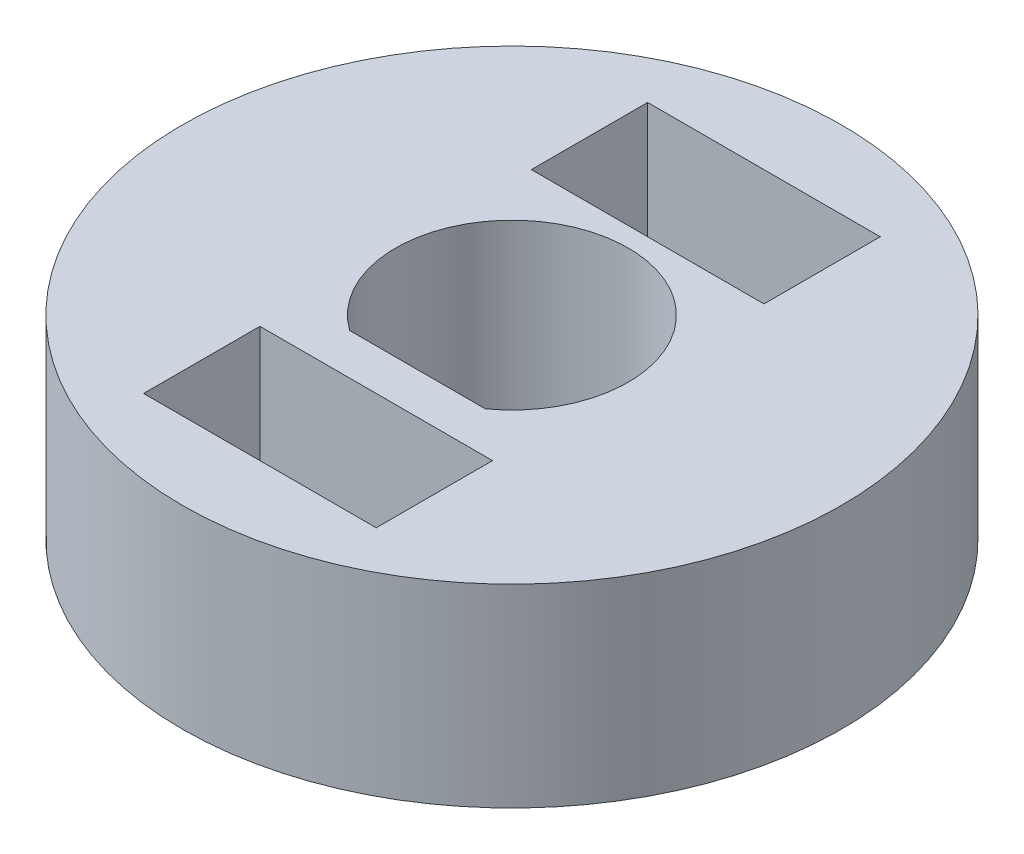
from build123d import *

# Parameters (mm, degrees)
SKETCH_1_R          = 8.5
EXTRUDE_1_DEPTH     = 5
SKETCH_2_W          = 6
SKETCH_2_H          = 3
CUT_EXTRUDE_1_DEPTH = 5


with BuildPart() as part:
    # Sketch 1 → Extrude 1 (new body)
    with BuildSketch(Plane(origin=(0, 0, 0), x_dir=(1, 0, 0), z_dir=(0, 1, 0))):
        with Locations(Location((0, 0, 0), (0, 0, 270))):
            Circle(SKETCH_1_R)
        with BuildLine():
            Line((-1.75, -2.436698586), (1.75, -2.436698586))
            ThreePointArc((1.75, -2.436698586), (0, 3), (-1.75, -2.436698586))
        make_face(mode=Mode.SUBTRACT)
    extrude(amount=EXTRUDE_1_DEPTH)

    # Sketch 2 → Cut-Extrude 1 (cut)
    with BuildSketch(Plane(origin=(0, 5, 0), x_dir=(1, 0, 0), z_dir=(0, 1, 0))):
        with Locations((0, -5)):
            Rectangle(SKETCH_2_W, SKETCH_2_H)
        with Locations((0, 5)):
            Rectangle(SKETCH_2_W, SKETCH_2_H)
    extrude(amount=-CUT_EXTRUDE_1_DEPTH, mode=Mode.SUBTRACT)


solid = part.part
